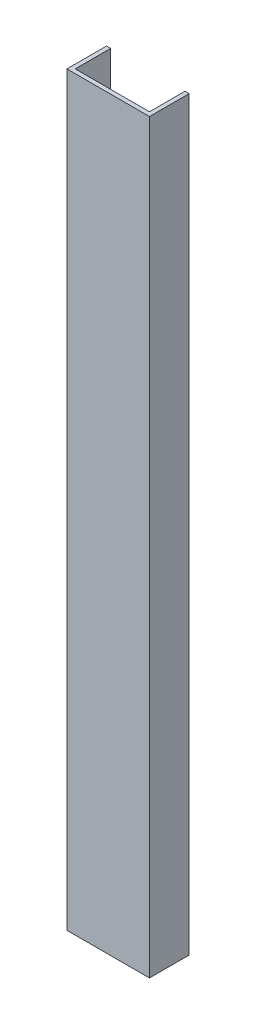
from build123d import *

# Parameters (mm, degrees)
BOSS_EXTRUDE1_DEPTH = 904


with BuildPart() as part:
    # Sketch1 → Boss-Extrude1 (new body)
    with BuildSketch(Plane(origin=(0, 0, 0), x_dir=(1, 0, 0), z_dir=(0, 1, 0))):
        Polygon((45, 48), (45, 5), (-45, 5), (-45, 48), (-50, 48), (-50, 0), (50, 0), (50, 48), align=None)
    extrude(amount=BOSS_EXTRUDE1_DEPTH)


solid = part.part
